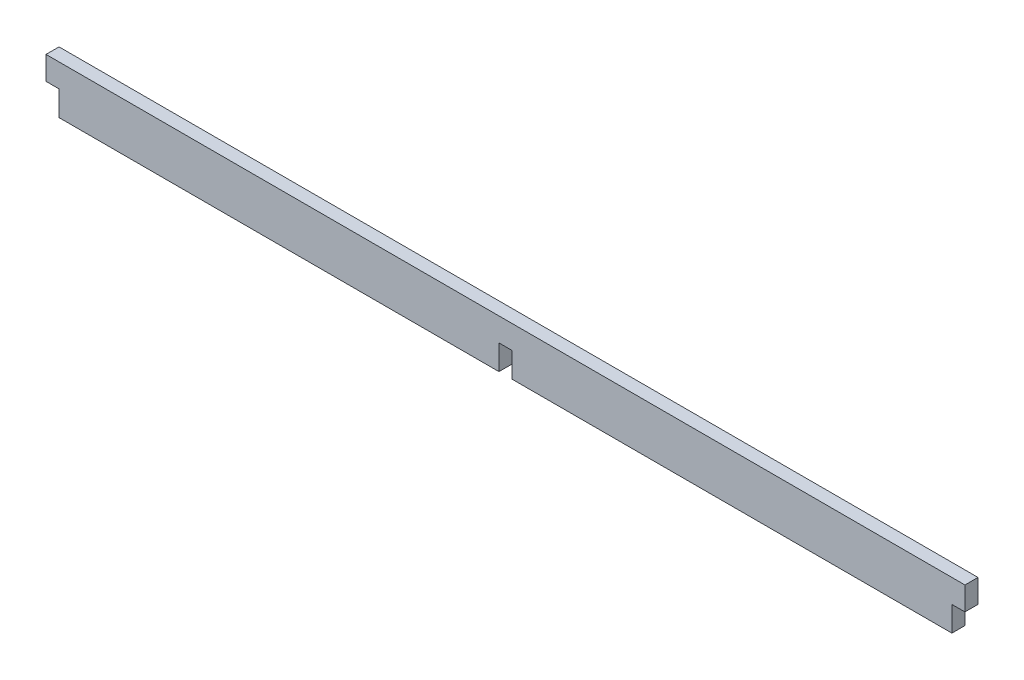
ISO-10303-21;
HEADER;
FILE_DESCRIPTION(('STEP AP214'),'2;1');
FILE_NAME('part.step','',(''),(''),'','','');
FILE_SCHEMA(('AUTOMOTIVE_DESIGN { 1 0 10303 214 1 1 1 1 }'));
ENDSEC;
DATA;
#1=APPLICATION_CONTEXT('core data for automotive mechanical design processes');
#2=APPLICATION_PROTOCOL_DEFINITION('international standard','automotive_design',2000,#1);
#3=PRODUCT_CONTEXT('',#1,'mechanical');
#4=PRODUCT('Part','Part','',(#3));
#5=PRODUCT_RELATED_PRODUCT_CATEGORY('part','',(#4));
#6=PRODUCT_DEFINITION_FORMATION('','',#4);
#7=PRODUCT_DEFINITION_CONTEXT('part definition',#1,'design');
#8=PRODUCT_DEFINITION('design','',#6,#7);
#9=PRODUCT_DEFINITION_SHAPE('','',#8);
#10=(LENGTH_UNIT() NAMED_UNIT(*) SI_UNIT(.MILLI.,.METRE.));
#11=(NAMED_UNIT(*) PLANE_ANGLE_UNIT() SI_UNIT($,.RADIAN.));
#12=(NAMED_UNIT(*) SI_UNIT($,.STERADIAN.) SOLID_ANGLE_UNIT());
#13=UNCERTAINTY_MEASURE_WITH_UNIT(LENGTH_MEASURE(1.E-05),#10,'distance_accuracy_value','');
#14=(GEOMETRIC_REPRESENTATION_CONTEXT(3) GLOBAL_UNCERTAINTY_ASSIGNED_CONTEXT((#13)) GLOBAL_UNIT_ASSIGNED_CONTEXT((#10,
#11,#12)) REPRESENTATION_CONTEXT('',''));
#15=CARTESIAN_POINT('',(0.,0.,0.));
#16=DIRECTION('',(0.,0.,1.));
#17=DIRECTION('',(1.,0.,0.));
#18=AXIS2_PLACEMENT_3D('',#15,#16,#17);
#19=CARTESIAN_POINT('',(0.,14.49,-3.2));
#20=DIRECTION('',(-1.,0.,0.));
#21=DIRECTION('',(0.,0.,-1.));
#22=AXIS2_PLACEMENT_3D('',#19,#20,#21);
#23=PLANE('',#22);
#24=DIRECTION('',(0.,1.,0.));
#25=VECTOR('',#24,1.);
#26=CARTESIAN_POINT('',(0.,14.49,0.));
#27=LINE('',#26,#25);
#28=CARTESIAN_POINT('',(0.,14.49,0.));
#29=VERTEX_POINT('',#28);
#30=CARTESIAN_POINT('',(0.,20.2223228,0.));
#31=VERTEX_POINT('',#30);
#32=EDGE_CURVE('E165',#29,#31,#27,.T.);
#33=ORIENTED_EDGE('',*,*,#32,.T.);
#34=DIRECTION('',(0.,0.,1.));
#35=VECTOR('',#34,1.);
#36=CARTESIAN_POINT('',(0.,20.2223228,-3.2));
#37=LINE('',#36,#35);
#38=CARTESIAN_POINT('',(0.,20.2223228,-3.2));
#39=VERTEX_POINT('',#38);
#40=EDGE_CURVE('E48',#39,#31,#37,.T.);
#41=ORIENTED_EDGE('',*,*,#40,.F.);
#42=DIRECTION('',(0.,1.,0.));
#43=VECTOR('',#42,1.);
#44=CARTESIAN_POINT('',(0.,14.49,-3.2));
#45=LINE('',#44,#43);
#46=CARTESIAN_POINT('',(0.,14.49,-3.2));
#47=VERTEX_POINT('',#46);
#48=EDGE_CURVE('E191',#47,#39,#45,.T.);
#49=ORIENTED_EDGE('',*,*,#48,.F.);
#50=DIRECTION('',(0.,0.,1.));
#51=VECTOR('',#50,1.);
#52=CARTESIAN_POINT('',(0.,14.49,-3.2));
#53=LINE('',#52,#51);
#54=EDGE_CURVE('E11',#47,#29,#53,.T.);
#55=ORIENTED_EDGE('',*,*,#54,.T.);
#56=EDGE_LOOP('',(#33,#41,#49,#55));
#57=FACE_BOUND('',#56,.T.);
#58=ADVANCED_FACE('F45',(#57),#23,.T.);
#59=CARTESIAN_POINT('',(0.,14.49,-3.2));
#60=DIRECTION('',(0.,1.,0.));
#61=DIRECTION('',(0.,0.,-1.));
#62=AXIS2_PLACEMENT_3D('',#59,#60,#61);
#63=PLANE('',#62);
#64=DIRECTION('',(1.,0.,0.));
#65=VECTOR('',#64,1.);
#66=CARTESIAN_POINT('',(0.,14.49,0.));
#67=LINE('',#66,#65);
#68=CARTESIAN_POINT('',(3.2,14.49,0.));
#69=VERTEX_POINT('',#68);
#70=EDGE_CURVE('E110',#29,#69,#67,.T.);
#71=ORIENTED_EDGE('',*,*,#70,.F.);
#72=ORIENTED_EDGE('',*,*,#54,.F.);
#73=DIRECTION('',(1.,0.,0.));
#74=VECTOR('',#73,1.);
#75=CARTESIAN_POINT('',(0.,14.49,-3.2));
#76=LINE('',#75,#74);
#77=CARTESIAN_POINT('',(3.2,14.49,-3.2));
#78=VERTEX_POINT('',#77);
#79=EDGE_CURVE('E63',#47,#78,#76,.T.);
#80=ORIENTED_EDGE('',*,*,#79,.T.);
#81=DIRECTION('',(0.,0.,1.));
#82=VECTOR('',#81,1.);
#83=CARTESIAN_POINT('',(3.2,14.49,-3.2));
#84=LINE('',#83,#82);
#85=EDGE_CURVE('E54',#78,#69,#84,.T.);
#86=ORIENTED_EDGE('',*,*,#85,.T.);
#87=EDGE_LOOP('',(#71,#72,#80,#86));
#88=FACE_BOUND('',#87,.T.);
#89=ADVANCED_FACE('F271',(#88),#63,.F.);
#90=CARTESIAN_POINT('',(3.2,8.384348,-3.2));
#91=DIRECTION('',(-1.,0.,0.));
#92=DIRECTION('',(0.,0.,-1.));
#93=AXIS2_PLACEMENT_3D('',#90,#91,#92);
#94=PLANE('',#93);
#95=DIRECTION('',(0.,1.,0.));
#96=VECTOR('',#95,1.);
#97=CARTESIAN_POINT('',(3.2,8.384348,0.));
#98=LINE('',#97,#96);
#99=CARTESIAN_POINT('',(3.2,8.384348,0.));
#100=VERTEX_POINT('',#99);
#101=EDGE_CURVE('E104',#100,#69,#98,.T.);
#102=ORIENTED_EDGE('',*,*,#101,.T.);
#103=ORIENTED_EDGE('',*,*,#85,.F.);
#104=DIRECTION('',(0.,1.,0.));
#105=VECTOR('',#104,1.);
#106=CARTESIAN_POINT('',(3.2,8.384348,-3.2));
#107=LINE('',#106,#105);
#108=CARTESIAN_POINT('',(3.2,8.384348,-3.2));
#109=VERTEX_POINT('',#108);
#110=EDGE_CURVE('E147',#109,#78,#107,.T.);
#111=ORIENTED_EDGE('',*,*,#110,.F.);
#112=DIRECTION('',(0.,0.,1.));
#113=VECTOR('',#112,1.);
#114=CARTESIAN_POINT('',(3.2,8.384348,-3.2));
#115=LINE('',#114,#113);
#116=EDGE_CURVE('E154',#109,#100,#115,.T.);
#117=ORIENTED_EDGE('',*,*,#116,.T.);
#118=EDGE_LOOP('',(#102,#103,#111,#117));
#119=FACE_BOUND('',#118,.T.);
#120=ADVANCED_FACE('F160',(#119),#94,.T.);
#121=CARTESIAN_POINT('',(3.2,8.384348,-3.2));
#122=DIRECTION('',(0.,1.,0.));
#123=DIRECTION('',(0.,0.,-1.));
#124=AXIS2_PLACEMENT_3D('',#121,#122,#123);
#125=PLANE('',#124);
#126=DIRECTION('',(1.,0.,0.));
#127=VECTOR('',#126,1.);
#128=CARTESIAN_POINT('',(3.2,8.384348,0.));
#129=LINE('',#128,#127);
#130=CARTESIAN_POINT('',(111.115,8.384348,0.));
#131=VERTEX_POINT('',#130);
#132=EDGE_CURVE('E157',#100,#131,#129,.T.);
#133=ORIENTED_EDGE('',*,*,#132,.F.);
#134=ORIENTED_EDGE('',*,*,#116,.F.);
#135=DIRECTION('',(1.,0.,0.));
#136=VECTOR('',#135,1.);
#137=CARTESIAN_POINT('',(3.2,8.384348,-3.2));
#138=LINE('',#137,#136);
#139=CARTESIAN_POINT('',(111.115,8.384348,-3.2));
#140=VERTEX_POINT('',#139);
#141=EDGE_CURVE('E143',#109,#140,#138,.T.);
#142=ORIENTED_EDGE('',*,*,#141,.T.);
#143=DIRECTION('',(0.,0.,1.));
#144=VECTOR('',#143,1.);
#145=CARTESIAN_POINT('',(111.115,8.384348,-3.2));
#146=LINE('',#145,#144);
#147=EDGE_CURVE('E158',#140,#131,#146,.T.);
#148=ORIENTED_EDGE('',*,*,#147,.T.);
#149=EDGE_LOOP('',(#133,#134,#142,#148));
#150=FACE_BOUND('',#149,.T.);
#151=ADVANCED_FACE('F155',(#150),#125,.F.);
#152=CARTESIAN_POINT('',(111.115,8.384348,-3.2));
#153=DIRECTION('',(-1.,0.,0.));
#154=DIRECTION('',(0.,0.,-1.));
#155=AXIS2_PLACEMENT_3D('',#152,#153,#154);
#156=PLANE('',#155);
#157=DIRECTION('',(0.,1.,0.));
#158=VECTOR('',#157,1.);
#159=CARTESIAN_POINT('',(111.115,8.384348,0.));
#160=LINE('',#159,#158);
#161=CARTESIAN_POINT('',(111.115,14.49,0.));
#162=VERTEX_POINT('',#161);
#163=EDGE_CURVE('E186',#131,#162,#160,.T.);
#164=ORIENTED_EDGE('',*,*,#163,.F.);
#165=ORIENTED_EDGE('',*,*,#147,.F.);
#166=DIRECTION('',(0.,1.,0.));
#167=VECTOR('',#166,1.);
#168=CARTESIAN_POINT('',(111.115,8.384348,-3.2));
#169=LINE('',#168,#167);
#170=CARTESIAN_POINT('',(111.115,14.49,-3.2));
#171=VERTEX_POINT('',#170);
#172=EDGE_CURVE('E149',#140,#171,#169,.T.);
#173=ORIENTED_EDGE('',*,*,#172,.T.);
#174=DIRECTION('',(0.,0.,1.));
#175=VECTOR('',#174,1.);
#176=CARTESIAN_POINT('',(111.115,14.49,-3.2));
#177=LINE('',#176,#175);
#178=EDGE_CURVE('E195',#171,#162,#177,.T.);
#179=ORIENTED_EDGE('',*,*,#178,.T.);
#180=EDGE_LOOP('',(#164,#165,#173,#179));
#181=FACE_BOUND('',#180,.T.);
#182=ADVANCED_FACE('F247',(#181),#156,.F.);
#183=CARTESIAN_POINT('',(111.115,14.49,-3.2));
#184=DIRECTION('',(0.,1.,0.));
#185=DIRECTION('',(0.,0.,-1.));
#186=AXIS2_PLACEMENT_3D('',#183,#184,#185);
#187=PLANE('',#186);
#188=DIRECTION('',(1.,0.,0.));
#189=VECTOR('',#188,1.);
#190=CARTESIAN_POINT('',(111.115,14.49,0.));
#191=LINE('',#190,#189);
#192=CARTESIAN_POINT('',(114.315,14.49,0.));
#193=VERTEX_POINT('',#192);
#194=EDGE_CURVE('E183',#162,#193,#191,.T.);
#195=ORIENTED_EDGE('',*,*,#194,.F.);
#196=ORIENTED_EDGE('',*,*,#178,.F.);
#197=DIRECTION('',(1.,0.,0.));
#198=VECTOR('',#197,1.);
#199=CARTESIAN_POINT('',(111.115,14.49,-3.2));
#200=LINE('',#199,#198);
#201=CARTESIAN_POINT('',(114.315,14.49,-3.2));
#202=VERTEX_POINT('',#201);
#203=EDGE_CURVE('E244',#171,#202,#200,.T.);
#204=ORIENTED_EDGE('',*,*,#203,.T.);
#205=DIRECTION('',(0.,0.,1.));
#206=VECTOR('',#205,1.);
#207=CARTESIAN_POINT('',(114.315,14.49,-3.2));
#208=LINE('',#207,#206);
#209=EDGE_CURVE('E198',#202,#193,#208,.T.);
#210=ORIENTED_EDGE('',*,*,#209,.T.);
#211=EDGE_LOOP('',(#195,#196,#204,#210));
#212=FACE_BOUND('',#211,.T.);
#213=ADVANCED_FACE('F251',(#212),#187,.F.);
#214=CARTESIAN_POINT('',(114.315,8.384348,-3.2));
#215=DIRECTION('',(-1.,0.,0.));
#216=DIRECTION('',(0.,0.,-1.));
#217=AXIS2_PLACEMENT_3D('',#214,#215,#216);
#218=PLANE('',#217);
#219=DIRECTION('',(0.,1.,0.));
#220=VECTOR('',#219,1.);
#221=CARTESIAN_POINT('',(114.315,8.384348,0.));
#222=LINE('',#221,#220);
#223=CARTESIAN_POINT('',(114.315,8.384348,0.));
#224=VERTEX_POINT('',#223);
#225=EDGE_CURVE('E181',#224,#193,#222,.T.);
#226=ORIENTED_EDGE('',*,*,#225,.T.);
#227=ORIENTED_EDGE('',*,*,#209,.F.);
#228=DIRECTION('',(0.,1.,0.));
#229=VECTOR('',#228,1.);
#230=CARTESIAN_POINT('',(114.315,8.384348,-3.2));
#231=LINE('',#230,#229);
#232=CARTESIAN_POINT('',(114.315,8.384348,-3.2));
#233=VERTEX_POINT('',#232);
#234=EDGE_CURVE('E242',#233,#202,#231,.T.);
#235=ORIENTED_EDGE('',*,*,#234,.F.);
#236=DIRECTION('',(0.,0.,1.));
#237=VECTOR('',#236,1.);
#238=CARTESIAN_POINT('',(114.315,8.384348,-3.2));
#239=LINE('',#238,#237);
#240=EDGE_CURVE('E201',#233,#224,#239,.T.);
#241=ORIENTED_EDGE('',*,*,#240,.T.);
#242=EDGE_LOOP('',(#226,#227,#235,#241));
#243=FACE_BOUND('',#242,.T.);
#244=ADVANCED_FACE('F255',(#243),#218,.T.);
#245=CARTESIAN_POINT('',(114.315,8.384348,-3.2));
#246=DIRECTION('',(0.,1.,0.));
#247=DIRECTION('',(0.,0.,-1.));
#248=AXIS2_PLACEMENT_3D('',#245,#246,#247);
#249=PLANE('',#248);
#250=DIRECTION('',(1.,0.,0.));
#251=VECTOR('',#250,1.);
#252=CARTESIAN_POINT('',(114.315,8.384348,0.));
#253=LINE('',#252,#251);
#254=CARTESIAN_POINT('',(222.225,8.384348,0.));
#255=VERTEX_POINT('',#254);
#256=EDGE_CURVE('E178',#224,#255,#253,.T.);
#257=ORIENTED_EDGE('',*,*,#256,.F.);
#258=ORIENTED_EDGE('',*,*,#240,.F.);
#259=DIRECTION('',(1.,0.,0.));
#260=VECTOR('',#259,1.);
#261=CARTESIAN_POINT('',(114.315,8.384348,-3.2));
#262=LINE('',#261,#260);
#263=CARTESIAN_POINT('',(222.225,8.384348,-3.2));
#264=VERTEX_POINT('',#263);
#265=EDGE_CURVE('E235',#233,#264,#262,.T.);
#266=ORIENTED_EDGE('',*,*,#265,.T.);
#267=DIRECTION('',(0.,0.,1.));
#268=VECTOR('',#267,1.);
#269=CARTESIAN_POINT('',(222.225,8.384348,-3.2));
#270=LINE('',#269,#268);
#271=EDGE_CURVE('E204',#264,#255,#270,.T.);
#272=ORIENTED_EDGE('',*,*,#271,.T.);
#273=EDGE_LOOP('',(#257,#258,#266,#272));
#274=FACE_BOUND('',#273,.T.);
#275=ADVANCED_FACE('F258',(#274),#249,.F.);
#276=CARTESIAN_POINT('',(222.225,8.384348,-3.2));
#277=DIRECTION('',(-1.,0.,0.));
#278=DIRECTION('',(0.,0.,-1.));
#279=AXIS2_PLACEMENT_3D('',#276,#277,#278);
#280=PLANE('',#279);
#281=DIRECTION('',(0.,1.,0.));
#282=VECTOR('',#281,1.);
#283=CARTESIAN_POINT('',(222.225,8.384348,0.));
#284=LINE('',#283,#282);
#285=CARTESIAN_POINT('',(222.225,14.49,0.));
#286=VERTEX_POINT('',#285);
#287=EDGE_CURVE('E175',#255,#286,#284,.T.);
#288=ORIENTED_EDGE('',*,*,#287,.F.);
#289=ORIENTED_EDGE('',*,*,#271,.F.);
#290=DIRECTION('',(0.,1.,0.));
#291=VECTOR('',#290,1.);
#292=CARTESIAN_POINT('',(222.225,8.384348,-3.2));
#293=LINE('',#292,#291);
#294=CARTESIAN_POINT('',(222.225,14.49,-3.2));
#295=VERTEX_POINT('',#294);
#296=EDGE_CURVE('E232',#264,#295,#293,.T.);
#297=ORIENTED_EDGE('',*,*,#296,.T.);
#298=DIRECTION('',(0.,0.,1.));
#299=VECTOR('',#298,1.);
#300=CARTESIAN_POINT('',(222.225,14.49,-3.2));
#301=LINE('',#300,#299);
#302=EDGE_CURVE('E207',#295,#286,#301,.T.);
#303=ORIENTED_EDGE('',*,*,#302,.T.);
#304=EDGE_LOOP('',(#288,#289,#297,#303));
#305=FACE_BOUND('',#304,.T.);
#306=ADVANCED_FACE('F261',(#305),#280,.F.);
#307=CARTESIAN_POINT('',(225.425,14.49,-3.2));
#308=DIRECTION('',(0.,-1.,0.));
#309=DIRECTION('',(0.,0.,1.));
#310=AXIS2_PLACEMENT_3D('',#307,#308,#309);
#311=PLANE('',#310);
#312=DIRECTION('',(-1.,0.,0.));
#313=VECTOR('',#312,1.);
#314=CARTESIAN_POINT('',(225.425,14.49,0.));
#315=LINE('',#314,#313);
#316=CARTESIAN_POINT('',(225.425,14.49,0.));
#317=VERTEX_POINT('',#316);
#318=EDGE_CURVE('E173',#317,#286,#315,.T.);
#319=ORIENTED_EDGE('',*,*,#318,.T.);
#320=ORIENTED_EDGE('',*,*,#302,.F.);
#321=DIRECTION('',(-1.,0.,0.));
#322=VECTOR('',#321,1.);
#323=CARTESIAN_POINT('',(225.425,14.49,-3.2));
#324=LINE('',#323,#322);
#325=CARTESIAN_POINT('',(225.425,14.49,-3.2));
#326=VERTEX_POINT('',#325);
#327=EDGE_CURVE('E230',#326,#295,#324,.T.);
#328=ORIENTED_EDGE('',*,*,#327,.F.);
#329=DIRECTION('',(0.,0.,1.));
#330=VECTOR('',#329,1.);
#331=CARTESIAN_POINT('',(225.425,14.49,-3.2));
#332=LINE('',#331,#330);
#333=EDGE_CURVE('E210',#326,#317,#332,.T.);
#334=ORIENTED_EDGE('',*,*,#333,.T.);
#335=EDGE_LOOP('',(#319,#320,#328,#334));
#336=FACE_BOUND('',#335,.T.);
#337=ADVANCED_FACE('F228',(#336),#311,.T.);
#338=CARTESIAN_POINT('',(225.425,14.49,-3.2));
#339=DIRECTION('',(-1.,0.,0.));
#340=DIRECTION('',(0.,0.,-1.));
#341=AXIS2_PLACEMENT_3D('',#338,#339,#340);
#342=PLANE('',#341);
#343=DIRECTION('',(0.,1.,0.));
#344=VECTOR('',#343,1.);
#345=CARTESIAN_POINT('',(225.425,14.49,0.));
#346=LINE('',#345,#344);
#347=CARTESIAN_POINT('',(225.425,20.2223228,0.));
#348=VERTEX_POINT('',#347);
#349=EDGE_CURVE('E170',#317,#348,#346,.T.);
#350=ORIENTED_EDGE('',*,*,#349,.F.);
#351=ORIENTED_EDGE('',*,*,#333,.F.);
#352=DIRECTION('',(0.,1.,0.));
#353=VECTOR('',#352,1.);
#354=CARTESIAN_POINT('',(225.425,14.49,-3.2));
#355=LINE('',#354,#353);
#356=CARTESIAN_POINT('',(225.425,20.2223228,-3.2));
#357=VERTEX_POINT('',#356);
#358=EDGE_CURVE('E233',#326,#357,#355,.T.);
#359=ORIENTED_EDGE('',*,*,#358,.T.);
#360=DIRECTION('',(0.,0.,1.));
#361=VECTOR('',#360,1.);
#362=CARTESIAN_POINT('',(225.425,20.2223228,-3.2));
#363=LINE('',#362,#361);
#364=EDGE_CURVE('E212',#357,#348,#363,.T.);
#365=ORIENTED_EDGE('',*,*,#364,.T.);
#366=EDGE_LOOP('',(#350,#351,#359,#365));
#367=FACE_BOUND('',#366,.T.);
#368=ADVANCED_FACE('F225',(#367),#342,.F.);
#369=CARTESIAN_POINT('',(0.,20.2223228,-3.2));
#370=DIRECTION('',(0.,1.,0.));
#371=DIRECTION('',(0.,0.,-1.));
#372=AXIS2_PLACEMENT_3D('',#369,#370,#371);
#373=PLANE('',#372);
#374=DIRECTION('',(1.,0.,0.));
#375=VECTOR('',#374,1.);
#376=CARTESIAN_POINT('',(0.,20.2223228,0.));
#377=LINE('',#376,#375);
#378=EDGE_CURVE('E168',#31,#348,#377,.T.);
#379=ORIENTED_EDGE('',*,*,#378,.T.);
#380=ORIENTED_EDGE('',*,*,#364,.F.);
#381=DIRECTION('',(1.,0.,0.));
#382=VECTOR('',#381,1.);
#383=CARTESIAN_POINT('',(0.,20.2223228,-3.2));
#384=LINE('',#383,#382);
#385=EDGE_CURVE('E118',#39,#357,#384,.T.);
#386=ORIENTED_EDGE('',*,*,#385,.F.);
#387=ORIENTED_EDGE('',*,*,#40,.T.);
#388=EDGE_LOOP('',(#379,#380,#386,#387));
#389=FACE_BOUND('',#388,.T.);
#390=ADVANCED_FACE('F217',(#389),#373,.T.);
#391=CARTESIAN_POINT('',(0.,0.,-3.2));
#392=DIRECTION('',(0.,0.,1.));
#393=DIRECTION('',(-1.,0.,0.));
#394=AXIS2_PLACEMENT_3D('',#391,#392,#393);
#395=PLANE('',#394);
#396=ORIENTED_EDGE('',*,*,#48,.T.);
#397=ORIENTED_EDGE('',*,*,#385,.T.);
#398=ORIENTED_EDGE('',*,*,#358,.F.);
#399=ORIENTED_EDGE('',*,*,#327,.T.);
#400=ORIENTED_EDGE('',*,*,#296,.F.);
#401=ORIENTED_EDGE('',*,*,#265,.F.);
#402=ORIENTED_EDGE('',*,*,#234,.T.);
#403=ORIENTED_EDGE('',*,*,#203,.F.);
#404=ORIENTED_EDGE('',*,*,#172,.F.);
#405=ORIENTED_EDGE('',*,*,#141,.F.);
#406=ORIENTED_EDGE('',*,*,#110,.T.);
#407=ORIENTED_EDGE('',*,*,#79,.F.);
#408=EDGE_LOOP('',(#396,#397,#398,#399,#400,#401,#402,#403,#404,#405,#406,#407));
#409=FACE_BOUND('',#408,.T.);
#410=ADVANCED_FACE('F145',(#409),#395,.F.);
#411=CARTESIAN_POINT('',(0.,0.,0.));
#412=DIRECTION('',(0.,0.,1.));
#413=DIRECTION('',(-1.,0.,0.));
#414=AXIS2_PLACEMENT_3D('',#411,#412,#413);
#415=PLANE('',#414);
#416=ORIENTED_EDGE('',*,*,#32,.F.);
#417=ORIENTED_EDGE('',*,*,#70,.T.);
#418=ORIENTED_EDGE('',*,*,#101,.F.);
#419=ORIENTED_EDGE('',*,*,#132,.T.);
#420=ORIENTED_EDGE('',*,*,#163,.T.);
#421=ORIENTED_EDGE('',*,*,#194,.T.);
#422=ORIENTED_EDGE('',*,*,#225,.F.);
#423=ORIENTED_EDGE('',*,*,#256,.T.);
#424=ORIENTED_EDGE('',*,*,#287,.T.);
#425=ORIENTED_EDGE('',*,*,#318,.F.);
#426=ORIENTED_EDGE('',*,*,#349,.T.);
#427=ORIENTED_EDGE('',*,*,#378,.F.);
#428=EDGE_LOOP('',(#416,#417,#418,#419,#420,#421,#422,#423,#424,#425,#426,#427));
#429=FACE_BOUND('',#428,.T.);
#430=ADVANCED_FACE('F222',(#429),#415,.T.);
#431=CLOSED_SHELL('',(#58,#89,#120,#151,#182,#213,#244,#275,#306,#337,#368,#390,#410,#430));
#432=MANIFOLD_SOLID_BREP('B2',#431);
#433=ADVANCED_BREP_SHAPE_REPRESENTATION('',(#18,#432),#14);
#434=SHAPE_DEFINITION_REPRESENTATION(#9,#433);
ENDSEC;
END-ISO-10303-21;
